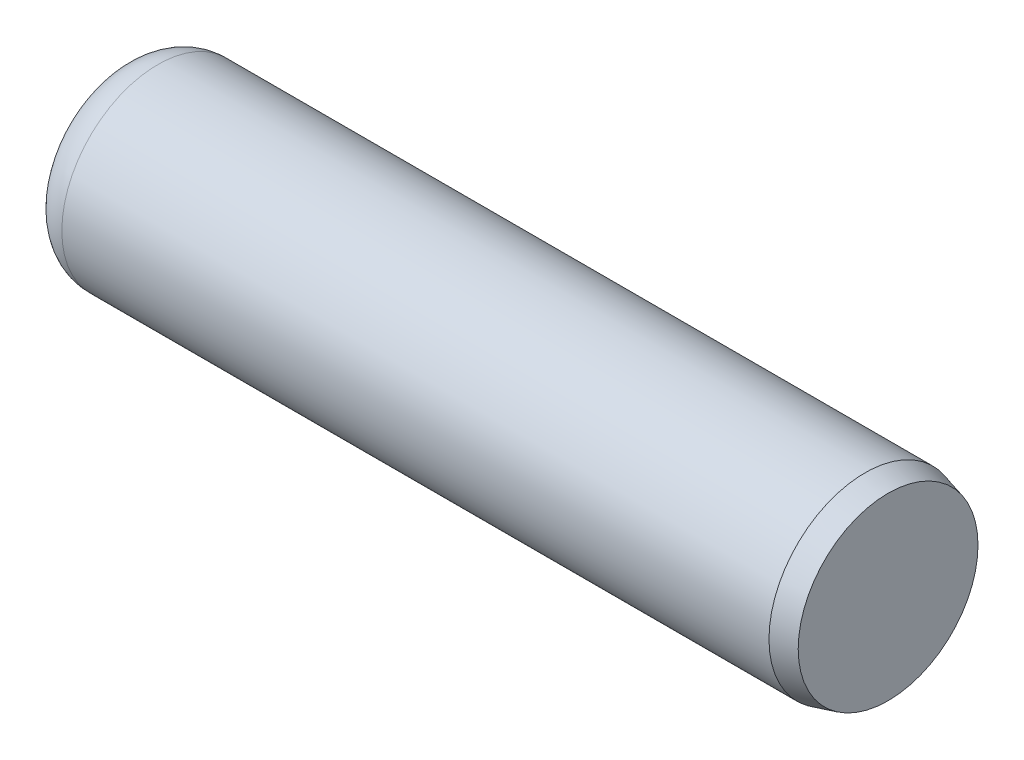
ISO-10303-21;
HEADER;
FILE_DESCRIPTION(('STEP AP214'),'2;1');
FILE_NAME('part.step','',(''),(''),'','','');
FILE_SCHEMA(('AUTOMOTIVE_DESIGN { 1 0 10303 214 1 1 1 1 }'));
ENDSEC;
DATA;
#1=APPLICATION_CONTEXT('core data for automotive mechanical design processes');
#2=APPLICATION_PROTOCOL_DEFINITION('international standard','automotive_design',2000,#1);
#3=PRODUCT_CONTEXT('',#1,'mechanical');
#4=PRODUCT('Part','Part','',(#3));
#5=PRODUCT_RELATED_PRODUCT_CATEGORY('part','',(#4));
#6=PRODUCT_DEFINITION_FORMATION('','',#4);
#7=PRODUCT_DEFINITION_CONTEXT('part definition',#1,'design');
#8=PRODUCT_DEFINITION('design','',#6,#7);
#9=PRODUCT_DEFINITION_SHAPE('','',#8);
#10=(LENGTH_UNIT() NAMED_UNIT(*) SI_UNIT(.MILLI.,.METRE.));
#11=(NAMED_UNIT(*) PLANE_ANGLE_UNIT() SI_UNIT($,.RADIAN.));
#12=(NAMED_UNIT(*) SI_UNIT($,.STERADIAN.) SOLID_ANGLE_UNIT());
#13=UNCERTAINTY_MEASURE_WITH_UNIT(LENGTH_MEASURE(1.E-05),#10,'distance_accuracy_value','');
#14=(GEOMETRIC_REPRESENTATION_CONTEXT(3) GLOBAL_UNCERTAINTY_ASSIGNED_CONTEXT((#13)) GLOBAL_UNIT_ASSIGNED_CONTEXT((#10,
#11,#12)) REPRESENTATION_CONTEXT('',''));
#15=CARTESIAN_POINT('',(0.,0.,0.));
#16=DIRECTION('',(0.,0.,1.));
#17=DIRECTION('',(1.,0.,0.));
#18=AXIS2_PLACEMENT_3D('',#15,#16,#17);
#19=CARTESIAN_POINT('',(0.,7.61999999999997,0.));
#20=DIRECTION('',(1.,0.,0.));
#21=DIRECTION('',(0.,0.,-1.));
#22=AXIS2_PLACEMENT_3D('',#19,#20,#21);
#23=PLANE('',#22);
#24=CARTESIAN_POINT('',(0.,0.,0.));
#25=DIRECTION('',(-1.,0.,0.));
#26=DIRECTION('',(0.,0.,1.));
#27=AXIS2_PLACEMENT_3D('',#24,#25,#26);
#28=CIRCLE('',#27,7.61999999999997);
#29=CARTESIAN_POINT('',(0.,0.,7.61999999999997));
#30=VERTEX_POINT('',#29);
#31=EDGE_CURVE('E45',#30,#30,#28,.T.);
#32=ORIENTED_EDGE('',*,*,#31,.T.);
#33=EDGE_LOOP('',(#32));
#34=FACE_BOUND('',#33,.T.);
#35=ADVANCED_FACE('F31',(#34),#23,.F.);
#36=CARTESIAN_POINT('',(101.6,0.,0.));
#37=DIRECTION('',(-1.,0.,0.));
#38=DIRECTION('',(0.,0.,1.));
#39=AXIS2_PLACEMENT_3D('',#36,#37,#38);
#40=PLANE('',#39);
#41=CARTESIAN_POINT('',(101.6,0.,0.));
#42=DIRECTION('',(-1.,0.,0.));
#43=DIRECTION('',(0.,0.,1.));
#44=AXIS2_PLACEMENT_3D('',#41,#42,#43);
#45=CIRCLE('',#44,11.8832908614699);
#46=CARTESIAN_POINT('',(101.6,0.,11.8832908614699));
#47=VERTEX_POINT('',#46);
#48=EDGE_CURVE('E10',#47,#47,#45,.T.);
#49=ORIENTED_EDGE('',*,*,#48,.F.);
#50=EDGE_LOOP('',(#49));
#51=FACE_BOUND('',#50,.T.);
#52=ADVANCED_FACE('F65',(#51),#40,.F.);
#53=CARTESIAN_POINT('',(101.6,0.,0.));
#54=DIRECTION('',(-1.,0.,0.));
#55=DIRECTION('',(0.,0.,1.));
#56=AXIS2_PLACEMENT_3D('',#53,#54,#55);
#57=CONICAL_SURFACE('',#56,11.8832908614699,0.26179938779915);
#58=CARTESIAN_POINT('',(98.552,0.,0.));
#59=DIRECTION('',(-1.,0.,0.));
#60=DIRECTION('',(0.,0.,1.));
#61=AXIS2_PLACEMENT_3D('',#58,#59,#60);
#62=CIRCLE('',#61,12.7);
#63=CARTESIAN_POINT('',(98.552,0.,12.7));
#64=VERTEX_POINT('',#63);
#65=EDGE_CURVE('E37',#64,#64,#62,.T.);
#66=ORIENTED_EDGE('',*,*,#65,.F.);
#67=EDGE_LOOP('',(#66));
#68=FACE_BOUND('',#67,.T.);
#69=ORIENTED_EDGE('',*,*,#48,.T.);
#70=EDGE_LOOP('',(#69));
#71=FACE_BOUND('',#70,.T.);
#72=ADVANCED_FACE('F60',(#68,#71),#57,.T.);
#73=CARTESIAN_POINT('',(-6.35,0.,0.));
#74=DIRECTION('',(-1.,0.,0.));
#75=DIRECTION('',(0.,0.,1.));
#76=AXIS2_PLACEMENT_3D('',#73,#74,#75);
#77=CYLINDRICAL_SURFACE('',#76,12.7);
#78=CARTESIAN_POINT('',(5.08,0.,0.));
#79=DIRECTION('',(-1.,0.,0.));
#80=DIRECTION('',(0.,0.,1.));
#81=AXIS2_PLACEMENT_3D('',#78,#79,#80);
#82=CIRCLE('',#81,12.7);
#83=CARTESIAN_POINT('',(5.08,0.,12.7));
#84=VERTEX_POINT('',#83);
#85=EDGE_CURVE('E41',#84,#84,#82,.T.);
#86=ORIENTED_EDGE('',*,*,#85,.F.);
#87=EDGE_LOOP('',(#86));
#88=FACE_BOUND('',#87,.T.);
#89=ORIENTED_EDGE('',*,*,#65,.T.);
#90=EDGE_LOOP('',(#89));
#91=FACE_BOUND('',#90,.T.);
#92=ADVANCED_FACE('F55',(#88,#91),#77,.T.);
#93=CARTESIAN_POINT('',(5.08,0.,0.));
#94=DIRECTION('',(-1.,0.,0.));
#95=DIRECTION('',(0.,0.,1.));
#96=AXIS2_PLACEMENT_3D('',#93,#94,#95);
#97=TOROIDAL_SURFACE('',#96,7.61999999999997,5.08);
#98=ORIENTED_EDGE('',*,*,#31,.F.);
#99=EDGE_LOOP('',(#98));
#100=FACE_BOUND('',#99,.T.);
#101=ORIENTED_EDGE('',*,*,#85,.T.);
#102=EDGE_LOOP('',(#101));
#103=FACE_BOUND('',#102,.T.);
#104=ADVANCED_FACE('F52',(#100,#103),#97,.T.);
#105=CLOSED_SHELL('',(#35,#52,#72,#92,#104));
#106=MANIFOLD_SOLID_BREP('B2',#105);
#107=ADVANCED_BREP_SHAPE_REPRESENTATION('',(#18,#106),#14);
#108=SHAPE_DEFINITION_REPRESENTATION(#9,#107);
ENDSEC;
END-ISO-10303-21;
